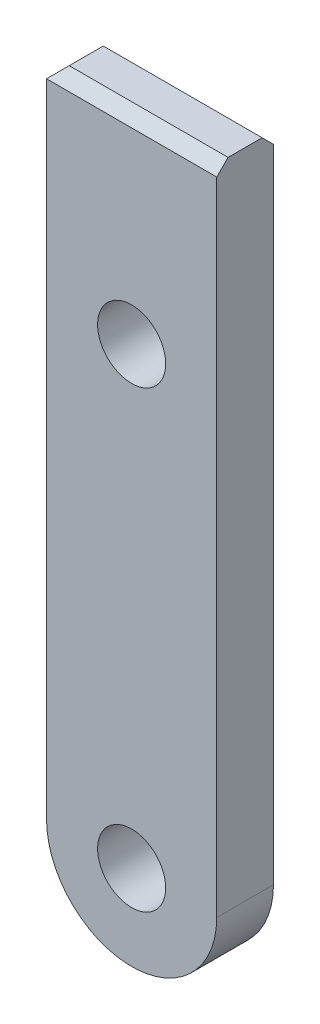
ISO-10303-21;
HEADER;
FILE_DESCRIPTION(('STEP AP214'),'2;1');
FILE_NAME('part.step','',(''),(''),'','','');
FILE_SCHEMA(('AUTOMOTIVE_DESIGN { 1 0 10303 214 1 1 1 1 }'));
ENDSEC;
DATA;
#1=APPLICATION_CONTEXT('core data for automotive mechanical design processes');
#2=APPLICATION_PROTOCOL_DEFINITION('international standard','automotive_design',2000,#1);
#3=PRODUCT_CONTEXT('',#1,'mechanical');
#4=PRODUCT('Part','Part','',(#3));
#5=PRODUCT_RELATED_PRODUCT_CATEGORY('part','',(#4));
#6=PRODUCT_DEFINITION_FORMATION('','',#4);
#7=PRODUCT_DEFINITION_CONTEXT('part definition',#1,'design');
#8=PRODUCT_DEFINITION('design','',#6,#7);
#9=PRODUCT_DEFINITION_SHAPE('','',#8);
#10=(LENGTH_UNIT() NAMED_UNIT(*) SI_UNIT(.MILLI.,.METRE.));
#11=(NAMED_UNIT(*) PLANE_ANGLE_UNIT() SI_UNIT($,.RADIAN.));
#12=(NAMED_UNIT(*) SI_UNIT($,.STERADIAN.) SOLID_ANGLE_UNIT());
#13=UNCERTAINTY_MEASURE_WITH_UNIT(LENGTH_MEASURE(1.E-05),#10,'distance_accuracy_value','');
#14=(GEOMETRIC_REPRESENTATION_CONTEXT(3) GLOBAL_UNCERTAINTY_ASSIGNED_CONTEXT((#13)) GLOBAL_UNIT_ASSIGNED_CONTEXT((#10,
#11,#12)) REPRESENTATION_CONTEXT('',''));
#15=CARTESIAN_POINT('',(0.,0.,0.));
#16=DIRECTION('',(0.,0.,1.));
#17=DIRECTION('',(1.,0.,0.));
#18=AXIS2_PLACEMENT_3D('',#15,#16,#17);
#19=CARTESIAN_POINT('',(0.,0.,10.));
#20=DIRECTION('',(1.,0.,0.));
#21=DIRECTION('',(0.,1.,0.));
#22=AXIS2_PLACEMENT_3D('',#19,#20,#21);
#23=PLANE('',#22);
#24=DIRECTION('',(0.,-1.,0.));
#25=VECTOR('',#24,1.);
#26=CARTESIAN_POINT('',(0.,0.,10.));
#27=LINE('',#26,#25);
#28=CARTESIAN_POINT('',(0.,-2.,10.));
#29=VERTEX_POINT('',#28);
#30=CARTESIAN_POINT('',(0.,-115.,10.));
#31=VERTEX_POINT('',#30);
#32=EDGE_CURVE('E93',#29,#31,#27,.T.);
#33=ORIENTED_EDGE('',*,*,#32,.F.);
#34=DIRECTION('',(0.,0.,-1.));
#35=VECTOR('',#34,1.);
#36=CARTESIAN_POINT('',(0.,-2.,10.));
#37=LINE('',#36,#35);
#38=CARTESIAN_POINT('',(0.,-2.00000000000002,0.));
#39=VERTEX_POINT('',#38);
#40=EDGE_CURVE('E135',#29,#39,#37,.T.);
#41=ORIENTED_EDGE('',*,*,#40,.T.);
#42=DIRECTION('',(0.,-1.,0.));
#43=VECTOR('',#42,1.);
#44=CARTESIAN_POINT('',(0.,0.,0.));
#45=LINE('',#44,#43);
#46=CARTESIAN_POINT('',(0.,-115.,0.));
#47=VERTEX_POINT('',#46);
#48=EDGE_CURVE('E117',#39,#47,#45,.T.);
#49=ORIENTED_EDGE('',*,*,#48,.T.);
#50=DIRECTION('',(0.,0.,-1.));
#51=VECTOR('',#50,1.);
#52=CARTESIAN_POINT('',(0.,-115.,10.));
#53=LINE('',#52,#51);
#54=EDGE_CURVE('E110',#31,#47,#53,.T.);
#55=ORIENTED_EDGE('',*,*,#54,.F.);
#56=EDGE_LOOP('',(#33,#41,#49,#55));
#57=FACE_BOUND('',#56,.T.);
#58=ADVANCED_FACE('F41',(#57),#23,.F.);
#59=CARTESIAN_POINT('',(15.,-115.,10.));
#60=DIRECTION('',(0.,0.,-1.));
#61=DIRECTION('',(-1.,0.,0.));
#62=AXIS2_PLACEMENT_3D('',#59,#60,#61);
#63=CYLINDRICAL_SURFACE('',#62,15.);
#64=CARTESIAN_POINT('',(15.,-115.,0.));
#65=DIRECTION('',(0.,0.,1.));
#66=DIRECTION('',(1.,0.,0.));
#67=AXIS2_PLACEMENT_3D('',#64,#65,#66);
#68=CIRCLE('',#67,15.);
#69=CARTESIAN_POINT('',(30.,-115.,0.));
#70=VERTEX_POINT('',#69);
#71=EDGE_CURVE('E143',#47,#70,#68,.T.);
#72=ORIENTED_EDGE('',*,*,#71,.T.);
#73=DIRECTION('',(0.,0.,-1.));
#74=VECTOR('',#73,1.);
#75=CARTESIAN_POINT('',(30.,-115.,10.));
#76=LINE('',#75,#74);
#77=CARTESIAN_POINT('',(30.,-115.,10.));
#78=VERTEX_POINT('',#77);
#79=EDGE_CURVE('E112',#78,#70,#76,.T.);
#80=ORIENTED_EDGE('',*,*,#79,.F.);
#81=CARTESIAN_POINT('',(15.,-115.,10.));
#82=DIRECTION('',(0.,0.,1.));
#83=DIRECTION('',(1.,0.,0.));
#84=AXIS2_PLACEMENT_3D('',#81,#82,#83);
#85=CIRCLE('',#84,15.);
#86=EDGE_CURVE('E97',#31,#78,#85,.T.);
#87=ORIENTED_EDGE('',*,*,#86,.F.);
#88=ORIENTED_EDGE('',*,*,#54,.T.);
#89=EDGE_LOOP('',(#72,#80,#87,#88));
#90=FACE_BOUND('',#89,.T.);
#91=ADVANCED_FACE('F109',(#90),#63,.T.);
#92=CARTESIAN_POINT('',(30.,0.,10.));
#93=DIRECTION('',(-1.,0.,0.));
#94=DIRECTION('',(0.,-1.,0.));
#95=AXIS2_PLACEMENT_3D('',#92,#93,#94);
#96=PLANE('',#95);
#97=DIRECTION('',(0.,0.,-1.));
#98=VECTOR('',#97,1.);
#99=CARTESIAN_POINT('',(30.,0.,10.));
#100=LINE('',#99,#98);
#101=CARTESIAN_POINT('',(30.,0.,7.99999999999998));
#102=VERTEX_POINT('',#101);
#103=CARTESIAN_POINT('',(30.,0.,2.));
#104=VERTEX_POINT('',#103);
#105=EDGE_CURVE('E122',#102,#104,#100,.T.);
#106=ORIENTED_EDGE('',*,*,#105,.F.);
#107=DIRECTION('',(0.,-0.707106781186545,0.70710678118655));
#108=VECTOR('',#107,1.);
#109=CARTESIAN_POINT('',(30.,-2.,10.));
#110=LINE('',#109,#108);
#111=CARTESIAN_POINT('',(30.,-2.,10.));
#112=VERTEX_POINT('',#111);
#113=EDGE_CURVE('E131',#102,#112,#110,.T.);
#114=ORIENTED_EDGE('',*,*,#113,.T.);
#115=DIRECTION('',(0.,1.,0.));
#116=VECTOR('',#115,1.);
#117=CARTESIAN_POINT('',(30.,0.,10.));
#118=LINE('',#117,#116);
#119=EDGE_CURVE('E114',#78,#112,#118,.T.);
#120=ORIENTED_EDGE('',*,*,#119,.F.);
#121=ORIENTED_EDGE('',*,*,#79,.T.);
#122=DIRECTION('',(0.,1.,0.));
#123=VECTOR('',#122,1.);
#124=CARTESIAN_POINT('',(30.,0.,0.));
#125=LINE('',#124,#123);
#126=CARTESIAN_POINT('',(30.,-2.00000000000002,0.));
#127=VERTEX_POINT('',#126);
#128=EDGE_CURVE('E105',#70,#127,#125,.T.);
#129=ORIENTED_EDGE('',*,*,#128,.T.);
#130=DIRECTION('',(0.,-0.70710678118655,-0.707106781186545));
#131=VECTOR('',#130,1.);
#132=CARTESIAN_POINT('',(30.,0.,2.));
#133=LINE('',#132,#131);
#134=EDGE_CURVE('E129',#127,#104,#133,.F.);
#135=ORIENTED_EDGE('',*,*,#134,.T.);
#136=EDGE_LOOP('',(#106,#114,#120,#121,#129,#135));
#137=FACE_BOUND('',#136,.T.);
#138=ADVANCED_FACE('F151',(#137),#96,.F.);
#139=CARTESIAN_POINT('',(0.,0.,10.));
#140=DIRECTION('',(0.,-1.,0.));
#141=DIRECTION('',(0.,0.,-1.));
#142=AXIS2_PLACEMENT_3D('',#139,#140,#141);
#143=PLANE('',#142);
#144=DIRECTION('',(-1.,0.,0.));
#145=VECTOR('',#144,1.);
#146=CARTESIAN_POINT('',(0.,0.,2.));
#147=LINE('',#146,#145);
#148=CARTESIAN_POINT('',(2.00000000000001,0.,2.));
#149=VERTEX_POINT('',#148);
#150=EDGE_CURVE('E120',#104,#149,#147,.T.);
#151=ORIENTED_EDGE('',*,*,#150,.T.);
#152=DIRECTION('',(0.,0.,1.));
#153=VECTOR('',#152,1.);
#154=CARTESIAN_POINT('',(2.00000000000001,0.,10.));
#155=LINE('',#154,#153);
#156=CARTESIAN_POINT('',(2.00000000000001,0.,7.99999999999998));
#157=VERTEX_POINT('',#156);
#158=EDGE_CURVE('E49',#149,#157,#155,.T.);
#159=ORIENTED_EDGE('',*,*,#158,.T.);
#160=DIRECTION('',(1.,0.,0.));
#161=VECTOR('',#160,1.);
#162=CARTESIAN_POINT('',(30.,0.,7.99999999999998));
#163=LINE('',#162,#161);
#164=EDGE_CURVE('E127',#157,#102,#163,.T.);
#165=ORIENTED_EDGE('',*,*,#164,.T.);
#166=ORIENTED_EDGE('',*,*,#105,.T.);
#167=EDGE_LOOP('',(#151,#159,#165,#166));
#168=FACE_BOUND('',#167,.T.);
#169=ADVANCED_FACE('F153',(#168),#143,.F.);
#170=CARTESIAN_POINT('',(15.,-115.,10.));
#171=DIRECTION('',(0.,0.,1.));
#172=DIRECTION('',(1.,0.,0.));
#173=AXIS2_PLACEMENT_3D('',#170,#171,#172);
#174=PLANE('',#173);
#175=CARTESIAN_POINT('',(15.,-35.,10.));
#176=DIRECTION('',(0.,0.,1.));
#177=DIRECTION('',(1.,0.,0.));
#178=AXIS2_PLACEMENT_3D('',#175,#176,#177);
#179=CIRCLE('',#178,6.);
#180=CARTESIAN_POINT('',(21.,-35.,10.));
#181=VERTEX_POINT('',#180);
#182=EDGE_CURVE('E164',#181,#181,#179,.T.);
#183=ORIENTED_EDGE('',*,*,#182,.F.);
#184=EDGE_LOOP('',(#183));
#185=FACE_BOUND('',#184,.T.);
#186=CARTESIAN_POINT('',(15.,-115.,10.));
#187=DIRECTION('',(0.,0.,1.));
#188=DIRECTION('',(1.,0.,0.));
#189=AXIS2_PLACEMENT_3D('',#186,#187,#188);
#190=CIRCLE('',#189,6.);
#191=CARTESIAN_POINT('',(21.,-115.,10.));
#192=VERTEX_POINT('',#191);
#193=EDGE_CURVE('E158',#192,#192,#190,.T.);
#194=ORIENTED_EDGE('',*,*,#193,.F.);
#195=EDGE_LOOP('',(#194));
#196=FACE_BOUND('',#195,.T.);
#197=ORIENTED_EDGE('',*,*,#119,.T.);
#198=DIRECTION('',(-1.,0.,0.));
#199=VECTOR('',#198,1.);
#200=CARTESIAN_POINT('',(0.,-2.,10.));
#201=LINE('',#200,#199);
#202=EDGE_CURVE('E100',#112,#29,#201,.T.);
#203=ORIENTED_EDGE('',*,*,#202,.T.);
#204=ORIENTED_EDGE('',*,*,#32,.T.);
#205=ORIENTED_EDGE('',*,*,#86,.T.);
#206=EDGE_LOOP('',(#197,#203,#204,#205));
#207=FACE_BOUND('',#206,.T.);
#208=ADVANCED_FACE('F96',(#185,#196,#207),#174,.T.);
#209=CARTESIAN_POINT('',(15.,-115.,0.));
#210=DIRECTION('',(0.,0.,1.));
#211=DIRECTION('',(1.,0.,0.));
#212=AXIS2_PLACEMENT_3D('',#209,#210,#211);
#213=PLANE('',#212);
#214=CARTESIAN_POINT('',(15.,-35.,0.));
#215=DIRECTION('',(0.,0.,1.));
#216=DIRECTION('',(1.,0.,0.));
#217=AXIS2_PLACEMENT_3D('',#214,#215,#216);
#218=CIRCLE('',#217,6.);
#219=CARTESIAN_POINT('',(21.,-35.,0.));
#220=VERTEX_POINT('',#219);
#221=EDGE_CURVE('E161',#220,#220,#218,.T.);
#222=ORIENTED_EDGE('',*,*,#221,.T.);
#223=EDGE_LOOP('',(#222));
#224=FACE_BOUND('',#223,.T.);
#225=CARTESIAN_POINT('',(15.,-115.,0.));
#226=DIRECTION('',(0.,0.,1.));
#227=DIRECTION('',(1.,0.,0.));
#228=AXIS2_PLACEMENT_3D('',#225,#226,#227);
#229=CIRCLE('',#228,6.);
#230=CARTESIAN_POINT('',(21.,-115.,0.));
#231=VERTEX_POINT('',#230);
#232=EDGE_CURVE('E144',#231,#231,#229,.T.);
#233=ORIENTED_EDGE('',*,*,#232,.T.);
#234=EDGE_LOOP('',(#233));
#235=FACE_BOUND('',#234,.T.);
#236=ORIENTED_EDGE('',*,*,#48,.F.);
#237=DIRECTION('',(1.,0.,0.));
#238=VECTOR('',#237,1.);
#239=CARTESIAN_POINT('',(15.,-2.00000000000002,0.));
#240=LINE('',#239,#238);
#241=EDGE_CURVE('E133',#39,#127,#240,.T.);
#242=ORIENTED_EDGE('',*,*,#241,.T.);
#243=ORIENTED_EDGE('',*,*,#128,.F.);
#244=ORIENTED_EDGE('',*,*,#71,.F.);
#245=EDGE_LOOP('',(#236,#242,#243,#244));
#246=FACE_BOUND('',#245,.T.);
#247=ADVANCED_FACE('F140',(#224,#235,#246),#213,.F.);
#248=CARTESIAN_POINT('',(15.,-115.,0.));
#249=DIRECTION('',(0.,0.,1.));
#250=DIRECTION('',(1.,0.,0.));
#251=AXIS2_PLACEMENT_3D('',#248,#249,#250);
#252=CYLINDRICAL_SURFACE('',#251,6.);
#253=ORIENTED_EDGE('',*,*,#232,.F.);
#254=EDGE_LOOP('',(#253));
#255=FACE_BOUND('',#254,.T.);
#256=ORIENTED_EDGE('',*,*,#193,.T.);
#257=EDGE_LOOP('',(#256));
#258=FACE_BOUND('',#257,.T.);
#259=ADVANCED_FACE('F176',(#255,#258),#252,.F.);
#260=CARTESIAN_POINT('',(15.,-35.,0.));
#261=DIRECTION('',(0.,0.,1.));
#262=DIRECTION('',(1.,0.,0.));
#263=AXIS2_PLACEMENT_3D('',#260,#261,#262);
#264=CYLINDRICAL_SURFACE('',#263,6.);
#265=ORIENTED_EDGE('',*,*,#221,.F.);
#266=EDGE_LOOP('',(#265));
#267=FACE_BOUND('',#266,.T.);
#268=ORIENTED_EDGE('',*,*,#182,.T.);
#269=EDGE_LOOP('',(#268));
#270=FACE_BOUND('',#269,.T.);
#271=ADVANCED_FACE('F172',(#267,#270),#264,.F.);
#272=CARTESIAN_POINT('',(15.,-2.,10.));
#273=DIRECTION('',(0.,0.70710678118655,0.707106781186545));
#274=DIRECTION('',(0.,-0.707106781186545,0.70710678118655));
#275=AXIS2_PLACEMENT_3D('',#272,#273,#274);
#276=PLANE('',#275);
#277=ORIENTED_EDGE('',*,*,#164,.F.);
#278=DIRECTION('',(0.577350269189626,0.577350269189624,-0.577350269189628));
#279=VECTOR('',#278,1.);
#280=CARTESIAN_POINT('',(5.,2.99999999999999,4.99999999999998));
#281=LINE('',#280,#279);
#282=EDGE_CURVE('E12',#157,#29,#281,.F.);
#283=ORIENTED_EDGE('',*,*,#282,.T.);
#284=ORIENTED_EDGE('',*,*,#202,.F.);
#285=ORIENTED_EDGE('',*,*,#113,.F.);
#286=EDGE_LOOP('',(#277,#283,#284,#285));
#287=FACE_BOUND('',#286,.T.);
#288=ADVANCED_FACE('F175',(#287),#276,.T.);
#289=CARTESIAN_POINT('',(0.,0.,2.));
#290=DIRECTION('',(0.,-0.707106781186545,0.70710678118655));
#291=DIRECTION('',(0.,-0.70710678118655,-0.707106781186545));
#292=AXIS2_PLACEMENT_3D('',#289,#290,#291);
#293=PLANE('',#292);
#294=ORIENTED_EDGE('',*,*,#241,.F.);
#295=DIRECTION('',(0.577350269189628,0.577350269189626,0.577350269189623));
#296=VECTOR('',#295,1.);
#297=CARTESIAN_POINT('',(1.33333333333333,-0.666666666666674,1.33333333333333));
#298=LINE('',#297,#296);
#299=EDGE_CURVE('E63',#39,#149,#298,.T.);
#300=ORIENTED_EDGE('',*,*,#299,.T.);
#301=ORIENTED_EDGE('',*,*,#150,.F.);
#302=ORIENTED_EDGE('',*,*,#134,.F.);
#303=EDGE_LOOP('',(#294,#300,#301,#302));
#304=FACE_BOUND('',#303,.T.);
#305=ADVANCED_FACE('F147',(#304),#293,.F.);
#306=CARTESIAN_POINT('',(0.,-2.,10.));
#307=DIRECTION('',(0.707106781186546,-0.707106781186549,0.));
#308=DIRECTION('',(0.707106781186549,0.707106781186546,0.));
#309=AXIS2_PLACEMENT_3D('',#306,#307,#308);
#310=PLANE('',#309);
#311=ORIENTED_EDGE('',*,*,#282,.F.);
#312=ORIENTED_EDGE('',*,*,#158,.F.);
#313=ORIENTED_EDGE('',*,*,#299,.F.);
#314=ORIENTED_EDGE('',*,*,#40,.F.);
#315=EDGE_LOOP('',(#311,#312,#313,#314));
#316=FACE_BOUND('',#315,.T.);
#317=ADVANCED_FACE('F43',(#316),#310,.F.);
#318=CLOSED_SHELL('',(#58,#91,#138,#169,#208,#247,#259,#271,#288,#305,#317));
#319=MANIFOLD_SOLID_BREP('B2',#318);
#320=ADVANCED_BREP_SHAPE_REPRESENTATION('',(#18,#319),#14);
#321=SHAPE_DEFINITION_REPRESENTATION(#9,#320);
ENDSEC;
END-ISO-10303-21;
